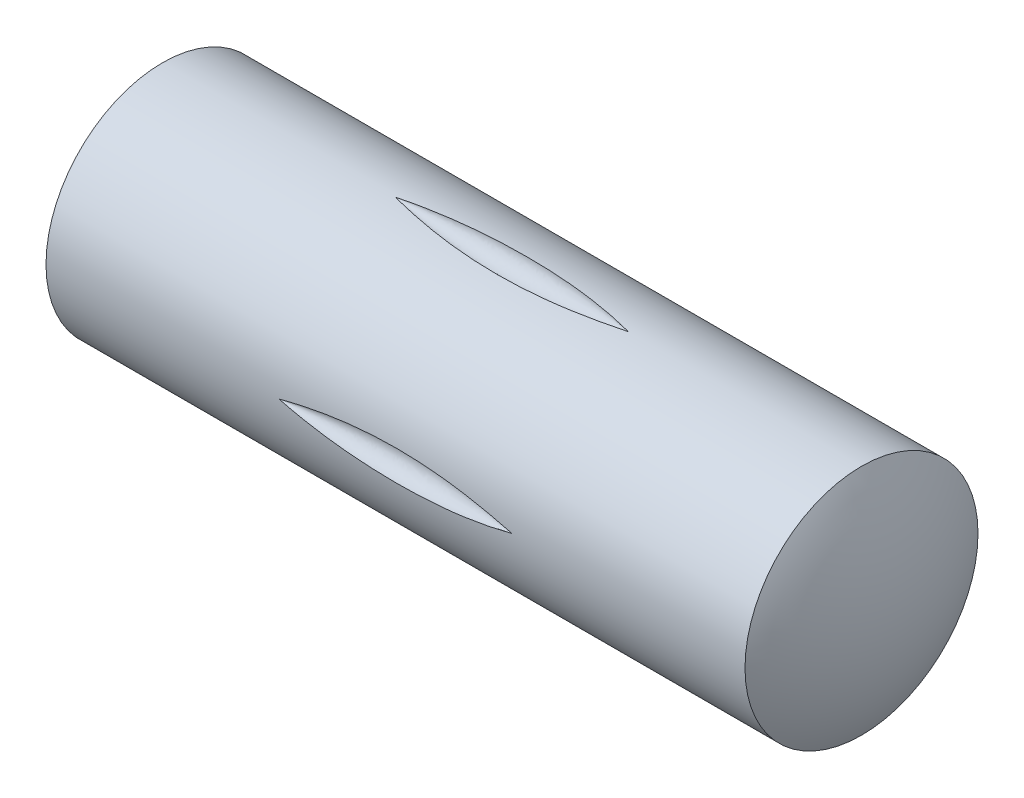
from build123d import *

# Parameters (mm, degrees)
R_P_TITION_CIRCULAIRE1_COUNT = 4


with BuildPart() as part:
    # Esquisse1 → Base-R_volution (revolve)
    with BuildSketch(Plane.XY, mode=Mode.PRIVATE) as base_r_volution_sk:
        with BuildLine():
            Line((1.3, 5), (31.3, 5))
            ThreePointArc((31.3, 5), (32.269685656, 2.583118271), (32.6, 0))
            Line((32.6, 0), (0, 0))
            ThreePointArc((0, 0), (0.330314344, 2.583118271), (1.3, 5))
        make_face()
    revolve(base_r_volution_sk.sketch.rotate(Axis((0, 0, 0), (1, 0, 0)), 90), axis=Axis((0, 0, 0), (1, 0, 0)))

    # Esquisse2 → Enlever de la mati_re-R_volution1 (revolve, cut)
    with BuildSketch(Plane(origin=(0, 5, 0), x_dir=(-1, 0, 0), z_dir=(0, 1, 0))):
        with BuildLine():
            Line((-11.3, 0), (-21.3, 0))
            ThreePointArc((-21.3, 0), (-18.821036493, 0.486819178), (-16.3, 0.65))
            ThreePointArc((-16.3, 0.65), (-13.778963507, 0.486819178), (-11.3, 0))
        make_face()
    enlever_de_la_mati_re_r_volution1 = revolve(axis=Axis((0, 5, 0), (1, 0, 0)), mode=Mode.SUBTRACT)

    # R_p_tition circulaire1: Enlever de la mati_re-R_volution1 ×4 about axis
    r_p_tition_circulaire1_axis = Axis((50, 0, 0), (-1, 0, 0))
    for i in range(1, R_P_TITION_CIRCULAIRE1_COUNT):
        add(enlever_de_la_mati_re_r_volution1.rotate(r_p_tition_circulaire1_axis, i * 360 / R_P_TITION_CIRCULAIRE1_COUNT), mode=Mode.SUBTRACT)


solid = part.part
